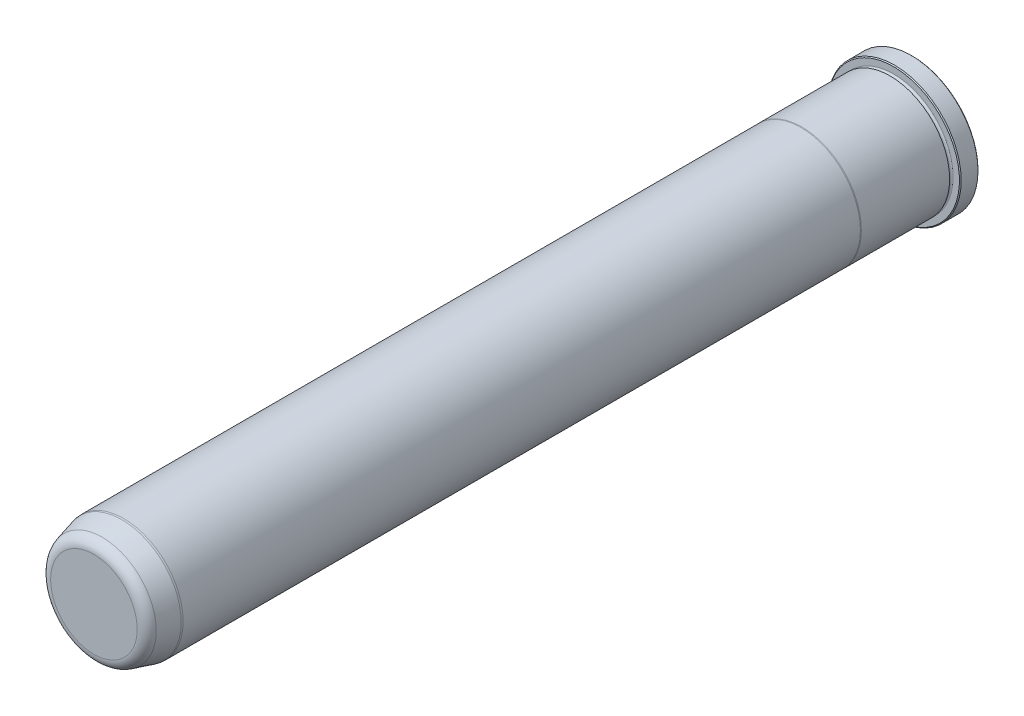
ISO-10303-21;
HEADER;
FILE_DESCRIPTION(('STEP AP214'),'2;1');
FILE_NAME('part.step','',(''),(''),'','','');
FILE_SCHEMA(('AUTOMOTIVE_DESIGN { 1 0 10303 214 1 1 1 1 }'));
ENDSEC;
DATA;
#1=APPLICATION_CONTEXT('core data for automotive mechanical design processes');
#2=APPLICATION_PROTOCOL_DEFINITION('international standard','automotive_design',2000,#1);
#3=PRODUCT_CONTEXT('',#1,'mechanical');
#4=PRODUCT('Part','Part','',(#3));
#5=PRODUCT_RELATED_PRODUCT_CATEGORY('part','',(#4));
#6=PRODUCT_DEFINITION_FORMATION('','',#4);
#7=PRODUCT_DEFINITION_CONTEXT('part definition',#1,'design');
#8=PRODUCT_DEFINITION('design','',#6,#7);
#9=PRODUCT_DEFINITION_SHAPE('','',#8);
#10=(LENGTH_UNIT() NAMED_UNIT(*) SI_UNIT(.MILLI.,.METRE.));
#11=(NAMED_UNIT(*) PLANE_ANGLE_UNIT() SI_UNIT($,.RADIAN.));
#12=(NAMED_UNIT(*) SI_UNIT($,.STERADIAN.) SOLID_ANGLE_UNIT());
#13=UNCERTAINTY_MEASURE_WITH_UNIT(LENGTH_MEASURE(1.E-05),#10,'distance_accuracy_value','');
#14=(GEOMETRIC_REPRESENTATION_CONTEXT(3) GLOBAL_UNCERTAINTY_ASSIGNED_CONTEXT((#13)) GLOBAL_UNIT_ASSIGNED_CONTEXT((#10,
#11,#12)) REPRESENTATION_CONTEXT('',''));
#15=CARTESIAN_POINT('',(0.,0.,0.));
#16=DIRECTION('',(0.,0.,1.));
#17=DIRECTION('',(1.,0.,0.));
#18=AXIS2_PLACEMENT_3D('',#15,#16,#17);
#19=CARTESIAN_POINT('',(0.,0.,0.));
#20=DIRECTION('',(0.,0.,1.));
#21=DIRECTION('',(1.,0.,0.));
#22=AXIS2_PLACEMENT_3D('',#19,#20,#21);
#23=PLANE('',#22);
#24=CARTESIAN_POINT('',(0.,0.,0.));
#25=DIRECTION('',(0.,0.,1.));
#26=DIRECTION('',(1.,0.,0.));
#27=AXIS2_PLACEMENT_3D('',#24,#25,#26);
#28=CIRCLE('',#27,28.067);
#29=CARTESIAN_POINT('',(28.067,0.,0.));
#30=VERTEX_POINT('',#29);
#31=EDGE_CURVE('E37',#30,#30,#28,.F.);
#32=ORIENTED_EDGE('',*,*,#31,.T.);
#33=EDGE_LOOP('',(#32));
#34=FACE_BOUND('',#33,.T.);
#35=ADVANCED_FACE('F30',(#34),#23,.F.);
#36=CARTESIAN_POINT('',(0.,0.,0.));
#37=DIRECTION('',(0.,0.,1.));
#38=DIRECTION('',(1.,0.,0.));
#39=AXIS2_PLACEMENT_3D('',#36,#37,#38);
#40=CYLINDRICAL_SURFACE('',#39,28.448);
#41=CARTESIAN_POINT('',(0.,0.,0.381000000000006));
#42=DIRECTION('',(0.,0.,1.));
#43=DIRECTION('',(1.,0.,0.));
#44=AXIS2_PLACEMENT_3D('',#41,#42,#43);
#45=CIRCLE('',#44,28.448);
#46=CARTESIAN_POINT('',(28.448,0.,0.381000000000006));
#47=VERTEX_POINT('',#46);
#48=EDGE_CURVE('E41',#47,#47,#45,.T.);
#49=CARTESIAN_POINT('',(0.,0.,7.54379999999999));
#50=DIRECTION('',(0.,0.,-1.));
#51=DIRECTION('',(-1.,0.,0.));
#52=AXIS2_PLACEMENT_3D('',#49,#50,#51);
#53=CIRCLE('',#52,28.448);
#54=CARTESIAN_POINT('',(28.448,0.,7.54379999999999));
#55=VERTEX_POINT('',#54);
#56=EDGE_CURVE('E45',#55,#55,#53,.T.);
#57=CARTESIAN_POINT('',(28.448,0.,0.381000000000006));
#58=CARTESIAN_POINT('',(28.448,0.,0.455612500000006));
#59=CARTESIAN_POINT('',(28.448,0.,0.530225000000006));
#60=CARTESIAN_POINT('',(28.448,0.,0.679450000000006));
#61=CARTESIAN_POINT('',(28.448,0.,0.754062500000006));
#62=CARTESIAN_POINT('',(28.448,0.,0.903287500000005));
#63=CARTESIAN_POINT('',(28.448,0.,0.977900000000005));
#64=CARTESIAN_POINT('',(28.448,0.,1.12712500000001));
#65=CARTESIAN_POINT('',(28.448,0.,1.2017375));
#66=CARTESIAN_POINT('',(28.448,0.,1.3509625));
#67=CARTESIAN_POINT('',(28.448,0.,1.425575));
#68=CARTESIAN_POINT('',(28.448,0.,1.5748));
#69=CARTESIAN_POINT('',(28.448,0.,1.6494125));
#70=CARTESIAN_POINT('',(28.448,0.,1.7986375));
#71=CARTESIAN_POINT('',(28.448,0.,1.87325));
#72=CARTESIAN_POINT('',(28.448,0.,2.022475));
#73=CARTESIAN_POINT('',(28.448,0.,2.0970875));
#74=CARTESIAN_POINT('',(28.448,0.,2.2463125));
#75=CARTESIAN_POINT('',(28.448,0.,2.320925));
#76=CARTESIAN_POINT('',(28.448,0.,2.47015));
#77=CARTESIAN_POINT('',(28.448,0.,2.5447625));
#78=CARTESIAN_POINT('',(28.448,0.,2.6939875));
#79=CARTESIAN_POINT('',(28.448,0.,2.7686));
#80=CARTESIAN_POINT('',(28.448,0.,2.917825));
#81=CARTESIAN_POINT('',(28.448,0.,2.9924375));
#82=CARTESIAN_POINT('',(28.448,0.,3.1416625));
#83=CARTESIAN_POINT('',(28.448,0.,3.216275));
#84=CARTESIAN_POINT('',(28.448,0.,3.3655));
#85=CARTESIAN_POINT('',(28.448,0.,3.4401125));
#86=CARTESIAN_POINT('',(28.448,0.,3.5893375));
#87=CARTESIAN_POINT('',(28.448,0.,3.66395));
#88=CARTESIAN_POINT('',(28.448,0.,3.813175));
#89=CARTESIAN_POINT('',(28.448,0.,3.8877875));
#90=CARTESIAN_POINT('',(28.448,0.,4.0370125));
#91=CARTESIAN_POINT('',(28.448,0.,4.111625));
#92=CARTESIAN_POINT('',(28.448,0.,4.26085));
#93=CARTESIAN_POINT('',(28.448,0.,4.3354625));
#94=CARTESIAN_POINT('',(28.448,0.,4.4846875));
#95=CARTESIAN_POINT('',(28.448,0.,4.5593));
#96=CARTESIAN_POINT('',(28.448,0.,4.708525));
#97=CARTESIAN_POINT('',(28.448,0.,4.7831375));
#98=CARTESIAN_POINT('',(28.448,0.,4.9323625));
#99=CARTESIAN_POINT('',(28.448,0.,5.006975));
#100=CARTESIAN_POINT('',(28.448,0.,5.1562));
#101=CARTESIAN_POINT('',(28.448,0.,5.2308125));
#102=CARTESIAN_POINT('',(28.448,0.,5.3800375));
#103=CARTESIAN_POINT('',(28.448,0.,5.45465));
#104=CARTESIAN_POINT('',(28.448,0.,5.603875));
#105=CARTESIAN_POINT('',(28.448,0.,5.6784875));
#106=CARTESIAN_POINT('',(28.448,0.,5.8277125));
#107=CARTESIAN_POINT('',(28.448,0.,5.902325));
#108=CARTESIAN_POINT('',(28.448,0.,6.05155));
#109=CARTESIAN_POINT('',(28.448,0.,6.1261625));
#110=CARTESIAN_POINT('',(28.448,0.,6.27538749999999));
#111=CARTESIAN_POINT('',(28.448,0.,6.35));
#112=CARTESIAN_POINT('',(28.448,0.,6.49922499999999));
#113=CARTESIAN_POINT('',(28.448,0.,6.5738375));
#114=CARTESIAN_POINT('',(28.448,0.,6.72306249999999));
#115=CARTESIAN_POINT('',(28.448,0.,6.79767499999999));
#116=CARTESIAN_POINT('',(28.448,0.,6.94689999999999));
#117=CARTESIAN_POINT('',(28.448,0.,7.02151249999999));
#118=CARTESIAN_POINT('',(28.448,0.,7.17073749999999));
#119=CARTESIAN_POINT('',(28.448,0.,7.24534999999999));
#120=CARTESIAN_POINT('',(28.448,0.,7.39457499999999));
#121=CARTESIAN_POINT('',(28.448,0.,7.46918749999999));
#122=CARTESIAN_POINT('',(28.448,0.,7.54379999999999));
#123=B_SPLINE_CURVE_WITH_KNOTS('',3,(#57,#58,#59,#60,#61,#62,#63,#64,#65,#66,#67,#68,#69,#70,
#71,#72,#73,#74,#75,#76,#77,#78,#79,#80,#81,#82,#83,#84,#85,#86,#87,#88,#89,#90,#91,#92,#93,#94,
#95,#96,#97,#98,#99,#100,#101,#102,#103,#104,#105,#106,#107,#108,#109,#110,#111,#112,#113,#114,
#115,#116,#117,#118,#119,#120,#121,#122),.UNSPECIFIED.,.F.,.F.,(4,2,2,2,2,2,2,2,2,2,2,2,2,2,2,2,
2,2,2,2,2,2,2,2,2,2,2,2,2,2,2,2,4),(0.,0.2238375,0.447674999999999,0.671512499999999,
0.895349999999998,1.1191875,1.343025,1.5668625,1.7907,2.0145375,2.238375,2.4622125,
2.68604999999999,2.90988749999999,3.13372499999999,3.35756249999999,3.58139999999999,
3.80523749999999,4.02907499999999,4.25291249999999,4.47674999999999,4.70058749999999,
4.92442499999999,5.14826249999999,5.37209999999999,5.59593749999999,5.81977499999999,
6.04361249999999,6.26744999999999,6.49128749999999,6.71512499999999,6.93896249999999,
7.16279999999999),.UNSPECIFIED.);
#124=EDGE_CURVE('BSEAM118',#47,#55,#123,.T.);
#125=ORIENTED_EDGE('',*,*,#48,.T.);
#126=ORIENTED_EDGE('',*,*,#56,.T.);
#127=ORIENTED_EDGE('',*,*,#124,.T.);
#128=ORIENTED_EDGE('',*,*,#124,.F.);
#129=EDGE_LOOP('',(#125,#127,#126,#128));
#130=FACE_BOUND('',#129,.T.);
#131=ADVANCED_FACE('F118',(#130),#40,.T.);
#132=CARTESIAN_POINT('',(0.,28.448,7.9248));
#133=DIRECTION('',(0.,0.,-1.));
#134=DIRECTION('',(-1.,0.,0.));
#135=AXIS2_PLACEMENT_3D('',#132,#133,#134);
#136=PLANE('',#135);
#137=CARTESIAN_POINT('',(0.,0.,7.9248));
#138=DIRECTION('',(0.,0.,-1.));
#139=DIRECTION('',(-1.,0.,0.));
#140=AXIS2_PLACEMENT_3D('',#137,#138,#139);
#141=CIRCLE('',#140,28.067);
#142=CARTESIAN_POINT('',(-28.067,0.,7.9248));
#143=VERTEX_POINT('',#142);
#144=EDGE_CURVE('E10',#143,#143,#141,.F.);
#145=ORIENTED_EDGE('',*,*,#144,.T.);
#146=EDGE_LOOP('',(#145));
#147=FACE_BOUND('',#146,.T.);
#148=CARTESIAN_POINT('',(0.,0.,7.9248));
#149=DIRECTION('',(0.,0.,1.));
#150=DIRECTION('',(1.,0.,0.));
#151=AXIS2_PLACEMENT_3D('',#148,#149,#150);
#152=CIRCLE('',#151,25.3873);
#153=CARTESIAN_POINT('',(25.3873,0.,7.9248));
#154=VERTEX_POINT('',#153);
#155=EDGE_CURVE('E56',#154,#154,#152,.T.);
#156=ORIENTED_EDGE('',*,*,#155,.F.);
#157=EDGE_LOOP('',(#156));
#158=FACE_BOUND('',#157,.T.);
#159=ADVANCED_FACE('F113',(#147,#158),#136,.F.);
#160=CARTESIAN_POINT('',(0.,0.,8.6868));
#161=DIRECTION('',(0.,0.,1.));
#162=DIRECTION('',(1.,0.,0.));
#163=AXIS2_PLACEMENT_3D('',#160,#161,#162);
#164=TOROIDAL_SURFACE('',#163,25.3873,0.761999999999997);
#165=CARTESIAN_POINT('',(0.,0.,9.44879999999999));
#166=DIRECTION('',(0.,0.,1.));
#167=DIRECTION('',(1.,0.,0.));
#168=AXIS2_PLACEMENT_3D('',#165,#166,#167);
#169=CIRCLE('',#168,25.3873);
#170=CARTESIAN_POINT('',(25.3873,0.,9.44879999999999));
#171=VERTEX_POINT('',#170);
#172=EDGE_CURVE('E59',#171,#171,#169,.T.);
#173=ORIENTED_EDGE('',*,*,#172,.F.);
#174=EDGE_LOOP('',(#173));
#175=FACE_BOUND('',#174,.T.);
#176=ORIENTED_EDGE('',*,*,#155,.T.);
#177=EDGE_LOOP('',(#176));
#178=FACE_BOUND('',#177,.T.);
#179=ADVANCED_FACE('F107',(#175,#178),#164,.F.);
#180=CARTESIAN_POINT('',(0.,25.3873,9.44879999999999));
#181=DIRECTION('',(0.,0.,1.));
#182=DIRECTION('',(1.,0.,0.));
#183=AXIS2_PLACEMENT_3D('',#180,#181,#182);
#184=PLANE('',#183);
#185=CARTESIAN_POINT('',(0.,0.,9.4488));
#186=DIRECTION('',(0.,0.,1.));
#187=DIRECTION('',(1.,0.,0.));
#188=AXIS2_PLACEMENT_3D('',#185,#186,#187);
#189=CIRCLE('',#188,25.4127);
#190=CARTESIAN_POINT('',(25.4127,0.,9.4488));
#191=VERTEX_POINT('',#190);
#192=EDGE_CURVE('E62',#191,#191,#189,.T.);
#193=ORIENTED_EDGE('',*,*,#192,.F.);
#194=EDGE_LOOP('',(#193));
#195=FACE_BOUND('',#194,.T.);
#196=ORIENTED_EDGE('',*,*,#172,.T.);
#197=EDGE_LOOP('',(#196));
#198=FACE_BOUND('',#197,.T.);
#199=ADVANCED_FACE('F101',(#195,#198),#184,.F.);
#200=CARTESIAN_POINT('',(0.,0.,0.));
#201=DIRECTION('',(0.,0.,1.));
#202=DIRECTION('',(1.,0.,0.));
#203=AXIS2_PLACEMENT_3D('',#200,#201,#202);
#204=CYLINDRICAL_SURFACE('',#203,25.4127);
#205=CARTESIAN_POINT('',(0.,0.,47.1347630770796));
#206=DIRECTION('',(0.,0.,1.));
#207=DIRECTION('',(1.,0.,0.));
#208=AXIS2_PLACEMENT_3D('',#205,#206,#207);
#209=CIRCLE('',#208,25.4127);
#210=CARTESIAN_POINT('',(25.4127,0.,47.1347630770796));
#211=VERTEX_POINT('',#210);
#212=EDGE_CURVE('E65',#211,#211,#209,.T.);
#213=ORIENTED_EDGE('',*,*,#212,.F.);
#214=EDGE_LOOP('',(#213));
#215=FACE_BOUND('',#214,.T.);
#216=ORIENTED_EDGE('',*,*,#192,.T.);
#217=EDGE_LOOP('',(#216));
#218=FACE_BOUND('',#217,.T.);
#219=ADVANCED_FACE('F95',(#215,#218),#204,.T.);
#220=CARTESIAN_POINT('',(0.,0.,47.1347630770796));
#221=DIRECTION('',(0.,0.,-1.));
#222=DIRECTION('',(-1.,0.,0.));
#223=AXIS2_PLACEMENT_3D('',#220,#221,#222);
#224=CONICAL_SURFACE('',#223,25.4127,0.0698131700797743);
#225=CARTESIAN_POINT('',(0.,0.,47.498));
#226=DIRECTION('',(0.,0.,1.));
#227=DIRECTION('',(1.,0.,0.));
#228=AXIS2_PLACEMENT_3D('',#225,#226,#227);
#229=CIRCLE('',#228,25.3873);
#230=CARTESIAN_POINT('',(25.3873,0.,47.498));
#231=VERTEX_POINT('',#230);
#232=EDGE_CURVE('E68',#231,#231,#229,.T.);
#233=ORIENTED_EDGE('',*,*,#232,.F.);
#234=EDGE_LOOP('',(#233));
#235=FACE_BOUND('',#234,.T.);
#236=ORIENTED_EDGE('',*,*,#212,.T.);
#237=EDGE_LOOP('',(#236));
#238=FACE_BOUND('',#237,.T.);
#239=ADVANCED_FACE('F89',(#235,#238),#224,.T.);
#240=CARTESIAN_POINT('',(0.,0.,0.));
#241=DIRECTION('',(0.,0.,1.));
#242=DIRECTION('',(1.,0.,0.));
#243=AXIS2_PLACEMENT_3D('',#240,#241,#242);
#244=CYLINDRICAL_SURFACE('',#243,25.3873);
#245=CARTESIAN_POINT('',(0.,0.,336.55));
#246=DIRECTION('',(0.,0.,1.));
#247=DIRECTION('',(1.,0.,0.));
#248=AXIS2_PLACEMENT_3D('',#245,#246,#247);
#249=CIRCLE('',#248,25.3873);
#250=CARTESIAN_POINT('',(25.3873,0.,336.55));
#251=VERTEX_POINT('',#250);
#252=EDGE_CURVE('E71',#251,#251,#249,.T.);
#253=ORIENTED_EDGE('',*,*,#252,.F.);
#254=EDGE_LOOP('',(#253));
#255=FACE_BOUND('',#254,.T.);
#256=ORIENTED_EDGE('',*,*,#232,.T.);
#257=EDGE_LOOP('',(#256));
#258=FACE_BOUND('',#257,.T.);
#259=ADVANCED_FACE('F83',(#255,#258),#244,.T.);
#260=CARTESIAN_POINT('',(0.,0.,336.55));
#261=DIRECTION('',(0.,0.,-1.));
#262=DIRECTION('',(-1.,0.,0.));
#263=AXIS2_PLACEMENT_3D('',#260,#261,#262);
#264=CONICAL_SURFACE('',#263,25.3873,0.0872664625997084);
#265=CARTESIAN_POINT('',(0.,0.,337.312));
#266=DIRECTION('',(0.,0.,1.));
#267=DIRECTION('',(1.,0.,0.));
#268=AXIS2_PLACEMENT_3D('',#265,#266,#267);
#269=CIRCLE('',#268,25.3206336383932);
#270=CARTESIAN_POINT('',(25.3206336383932,0.,337.312));
#271=VERTEX_POINT('',#270);
#272=EDGE_CURVE('E74',#271,#271,#269,.T.);
#273=ORIENTED_EDGE('',*,*,#272,.F.);
#274=EDGE_LOOP('',(#273));
#275=FACE_BOUND('',#274,.T.);
#276=ORIENTED_EDGE('',*,*,#252,.T.);
#277=EDGE_LOOP('',(#276));
#278=FACE_BOUND('',#277,.T.);
#279=ADVANCED_FACE('F80',(#275,#278),#264,.T.);
#280=CARTESIAN_POINT('',(0.,0.,337.312));
#281=DIRECTION('',(0.,0.,-1.));
#282=DIRECTION('',(-1.,0.,0.));
#283=AXIS2_PLACEMENT_3D('',#280,#281,#282);
#284=CONICAL_SURFACE('',#283,25.3206336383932,0.261799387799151);
#285=CARTESIAN_POINT('',(0.,0.,345.720125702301));
#286=DIRECTION('',(0.,0.,1.));
#287=DIRECTION('',(1.,0.,0.));
#288=AXIS2_PLACEMENT_3D('',#285,#286,#287);
#289=CIRCLE('',#288,23.0676831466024);
#290=CARTESIAN_POINT('',(23.0676831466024,0.,345.720125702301));
#291=VERTEX_POINT('',#290);
#292=EDGE_CURVE('E50',#291,#291,#289,.F.);
#293=ORIENTED_EDGE('',*,*,#292,.T.);
#294=EDGE_LOOP('',(#293));
#295=FACE_BOUND('',#294,.T.);
#296=ORIENTED_EDGE('',*,*,#272,.T.);
#297=EDGE_LOOP('',(#296));
#298=FACE_BOUND('',#297,.T.);
#299=ADVANCED_FACE('F78',(#295,#298),#284,.T.);
#300=CARTESIAN_POINT('',(0.,22.1218561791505,349.25));
#301=DIRECTION('',(0.,0.,-1.));
#302=DIRECTION('',(-1.,0.,0.));
#303=AXIS2_PLACEMENT_3D('',#300,#301,#302);
#304=PLANE('',#303);
#305=CARTESIAN_POINT('',(0.,0.,349.25));
#306=DIRECTION('',(0.,0.,-1.));
#307=DIRECTION('',(-1.,0.,0.));
#308=AXIS2_PLACEMENT_3D('',#305,#306,#307);
#309=CIRCLE('',#308,18.4674613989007);
#310=CARTESIAN_POINT('',(-18.4674613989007,0.,349.25));
#311=VERTEX_POINT('',#310);
#312=EDGE_CURVE('E53',#311,#311,#309,.F.);
#313=ORIENTED_EDGE('',*,*,#312,.T.);
#314=EDGE_LOOP('',(#313));
#315=FACE_BOUND('',#314,.T.);
#316=ADVANCED_FACE('F133',(#315),#304,.F.);
#317=CARTESIAN_POINT('',(0.,0.,344.4875));
#318=DIRECTION('',(0.,0.,-1.));
#319=DIRECTION('',(-1.,0.,0.));
#320=AXIS2_PLACEMENT_3D('',#317,#318,#319);
#321=TOROIDAL_SURFACE('',#320,18.4674613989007,4.7625);
#322=ORIENTED_EDGE('',*,*,#292,.F.);
#323=EDGE_LOOP('',(#322));
#324=FACE_BOUND('',#323,.T.);
#325=ORIENTED_EDGE('',*,*,#312,.F.);
#326=EDGE_LOOP('',(#325));
#327=FACE_BOUND('',#326,.T.);
#328=ADVANCED_FACE('F130',(#324,#327),#321,.T.);
#329=CARTESIAN_POINT('',(0.,0.,0.381000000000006));
#330=DIRECTION('',(0.,0.,1.));
#331=DIRECTION('',(1.,0.,0.));
#332=AXIS2_PLACEMENT_3D('',#329,#330,#331);
#333=CONICAL_SURFACE('',#332,28.448,0.785398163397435);
#334=CARTESIAN_POINT('',(28.067,0.,0.));
#335=CARTESIAN_POINT('',(28.07096875,0.,0.00396875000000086));
#336=CARTESIAN_POINT('',(28.0749375,0.,0.00793750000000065));
#337=CARTESIAN_POINT('',(28.082875,0.,0.0158750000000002));
#338=CARTESIAN_POINT('',(28.08684375,0.,0.01984375));
#339=CARTESIAN_POINT('',(28.09478125,0.,0.0277812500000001));
#340=CARTESIAN_POINT('',(28.09875,0.,0.0317500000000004));
#341=CARTESIAN_POINT('',(28.1066875,0.,0.0396875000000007));
#342=CARTESIAN_POINT('',(28.11065625,0.,0.0436562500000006));
#343=CARTESIAN_POINT('',(28.11859375,0.,0.0515937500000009));
#344=CARTESIAN_POINT('',(28.1225625,0.,0.0555625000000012));
#345=CARTESIAN_POINT('',(28.1305,0.,0.0635000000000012));
#346=CARTESIAN_POINT('',(28.13446875,0.,0.0674687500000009));
#347=CARTESIAN_POINT('',(28.14240625,0.,0.0754062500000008));
#348=CARTESIAN_POINT('',(28.146375,0.,0.0793750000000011));
#349=CARTESIAN_POINT('',(28.1543125,0.,0.0873125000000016));
#350=CARTESIAN_POINT('',(28.15828125,0.,0.0912812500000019));
#351=CARTESIAN_POINT('',(28.16621875,0.,0.0992187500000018));
#352=CARTESIAN_POINT('',(28.1701875,0.,0.103187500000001));
#353=CARTESIAN_POINT('',(28.178125,0.,0.111125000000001));
#354=CARTESIAN_POINT('',(28.18209375,0.,0.115093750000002));
#355=CARTESIAN_POINT('',(28.19003125,0.,0.123031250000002));
#356=CARTESIAN_POINT('',(28.194,0.,0.127000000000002));
#357=CARTESIAN_POINT('',(28.2019375,0.,0.134937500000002));
#358=CARTESIAN_POINT('',(28.20590625,0.,0.138906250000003));
#359=CARTESIAN_POINT('',(28.21384375,0.,0.146843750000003));
#360=CARTESIAN_POINT('',(28.2178125,0.,0.150812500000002));
#361=CARTESIAN_POINT('',(28.22575,0.,0.158750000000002));
#362=CARTESIAN_POINT('',(28.22971875,0.,0.162718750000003));
#363=CARTESIAN_POINT('',(28.23765625,0.,0.170656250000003));
#364=CARTESIAN_POINT('',(28.241625,0.,0.174625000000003));
#365=CARTESIAN_POINT('',(28.2495625,0.,0.182562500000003));
#366=CARTESIAN_POINT('',(28.25353125,0.,0.186531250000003));
#367=CARTESIAN_POINT('',(28.26146875,0.,0.194468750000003));
#368=CARTESIAN_POINT('',(28.2654375,0.,0.198437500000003));
#369=CARTESIAN_POINT('',(28.273375,0.,0.206375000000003));
#370=CARTESIAN_POINT('',(28.27734375,0.,0.210343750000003));
#371=CARTESIAN_POINT('',(28.28528125,0.,0.218281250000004));
#372=CARTESIAN_POINT('',(28.28925,0.,0.222250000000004));
#373=CARTESIAN_POINT('',(28.2971875,0.,0.230187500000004));
#374=CARTESIAN_POINT('',(28.30115625,0.,0.234156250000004));
#375=CARTESIAN_POINT('',(28.30909375,0.,0.242093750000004));
#376=CARTESIAN_POINT('',(28.3130625,0.,0.246062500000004));
#377=CARTESIAN_POINT('',(28.321,0.,0.254000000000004));
#378=CARTESIAN_POINT('',(28.32496875,0.,0.257968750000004));
#379=CARTESIAN_POINT('',(28.33290625,0.,0.265906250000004));
#380=CARTESIAN_POINT('',(28.336875,0.,0.269875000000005));
#381=CARTESIAN_POINT('',(28.3448125,0.,0.277812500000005));
#382=CARTESIAN_POINT('',(28.34878125,0.,0.281781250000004));
#383=CARTESIAN_POINT('',(28.35671875,0.,0.289718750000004));
#384=CARTESIAN_POINT('',(28.3606875,0.,0.293687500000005));
#385=CARTESIAN_POINT('',(28.368625,0.,0.301625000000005));
#386=CARTESIAN_POINT('',(28.37259375,0.,0.305593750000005));
#387=CARTESIAN_POINT('',(28.38053125,0.,0.313531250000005));
#388=CARTESIAN_POINT('',(28.3845,0.,0.317500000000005));
#389=CARTESIAN_POINT('',(28.3924375,0.,0.325437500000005));
#390=CARTESIAN_POINT('',(28.39640625,0.,0.329406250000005));
#391=CARTESIAN_POINT('',(28.40434375,0.,0.337343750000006));
#392=CARTESIAN_POINT('',(28.4083125,0.,0.341312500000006));
#393=CARTESIAN_POINT('',(28.41625,0.,0.349250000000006));
#394=CARTESIAN_POINT('',(28.42021875,0.,0.353218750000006));
#395=CARTESIAN_POINT('',(28.42815625,0.,0.361156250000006));
#396=CARTESIAN_POINT('',(28.432125,0.,0.365125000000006));
#397=CARTESIAN_POINT('',(28.4400625,0.,0.373062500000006));
#398=CARTESIAN_POINT('',(28.44403125,0.,0.377031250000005));
#399=CARTESIAN_POINT('',(28.448,0.,0.381000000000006));
#400=B_SPLINE_CURVE_WITH_KNOTS('',3,(#334,#335,#336,#337,#338,#339,#340,#341,#342,#343,#344,
#345,#346,#347,#348,#349,#350,#351,#352,#353,#354,#355,#356,#357,#358,#359,#360,#361,#362,#363,
#364,#365,#366,#367,#368,#369,#370,#371,#372,#373,#374,#375,#376,#377,#378,#379,#380,#381,#382,
#383,#384,#385,#386,#387,#388,#389,#390,#391,#392,#393,#394,#395,#396,#397,#398,#399),
.UNSPECIFIED.,.F.,.F.,(4,2,2,2,2,2,2,2,2,2,2,2,2,2,2,2,2,2,2,2,2,2,2,2,2,2,2,2,2,2,2,2,4),(0.,
0.016837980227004,0.0336759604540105,0.0505139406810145,0.0673519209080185,0.0841899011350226,
0.101027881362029,0.117865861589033,0.134703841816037,0.151541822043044,0.168379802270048,
0.185217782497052,0.202055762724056,0.218893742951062,0.235731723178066,0.25256970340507,
0.269407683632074,0.286245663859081,0.303083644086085,0.319921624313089,0.336759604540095,
0.353597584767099,0.370435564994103,0.387273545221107,0.404111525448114,0.420949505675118,
0.437787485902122,0.454625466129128,0.471463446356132,0.488301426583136,0.50513940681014,
0.521977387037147,0.538815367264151),.UNSPECIFIED.);
#401=EDGE_CURVE('BSEAM132',#30,#47,#400,.T.);
#402=ORIENTED_EDGE('',*,*,#31,.F.);
#403=ORIENTED_EDGE('',*,*,#48,.F.);
#404=ORIENTED_EDGE('',*,*,#401,.T.);
#405=ORIENTED_EDGE('',*,*,#401,.F.);
#406=EDGE_LOOP('',(#402,#404,#403,#405));
#407=FACE_BOUND('',#406,.T.);
#408=ADVANCED_FACE('F132',(#407),#333,.T.);
#409=CARTESIAN_POINT('',(0.,0.,7.9248));
#410=DIRECTION('',(0.,0.,-1.));
#411=DIRECTION('',(-1.,0.,0.));
#412=AXIS2_PLACEMENT_3D('',#409,#410,#411);
#413=CONICAL_SURFACE('',#412,28.067,0.785398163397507);
#414=ORIENTED_EDGE('',*,*,#56,.F.);
#415=EDGE_LOOP('',(#414));
#416=FACE_BOUND('',#415,.T.);
#417=ORIENTED_EDGE('',*,*,#144,.F.);
#418=EDGE_LOOP('',(#417));
#419=FACE_BOUND('',#418,.T.);
#420=ADVANCED_FACE('F32',(#416,#419),#413,.T.);
#421=CLOSED_SHELL('',(#35,#131,#159,#179,#199,#219,#239,#259,#279,#299,#316,#328,#408,#420));
#422=MANIFOLD_SOLID_BREP('B2',#421);
#423=ADVANCED_BREP_SHAPE_REPRESENTATION('',(#18,#422),#14);
#424=SHAPE_DEFINITION_REPRESENTATION(#9,#423);
ENDSEC;
END-ISO-10303-21;
